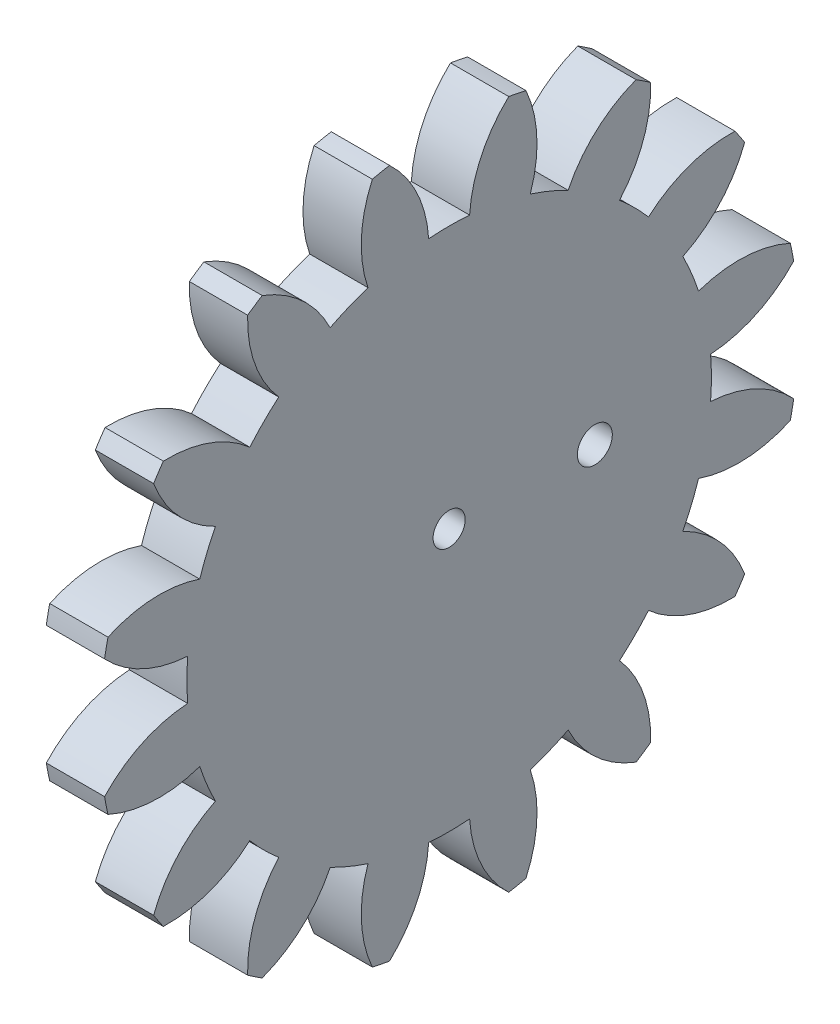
from build123d import *

# Parameters (mm, degrees)
BASPROSKE_W         = 6.35
BASPROSKE_H         = 38.1
TOOTHCUT_DEPTH      = 55.254423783
TEETHCUTS_COUNT     = 16
TEETHCUTS_ANGLE     = 337.5
BORSKE_R            = 3.175
BORE_DEPTH          = 50.8000508
SKETCH1_R           = 3.175
SKETCH1_R_2         = 1.75
BOSS_EXTRUDE1_DEPTH = 6.35
CUT_EXTRUDE1_REACH  = 55.471
SKETCH2_R           = 1.905


with BuildPart() as part:
    # BasProSke → Base-Revolve (revolve)
    with BuildSketch(Plane(origin=(0, 0, 0), x_dir=(1, 0, 0), z_dir=(0, 1, 0)), mode=Mode.PRIVATE) as base_revolve_sk:
        with Locations((3.175, 19.05)):
            Rectangle(BASPROSKE_W, BASPROSKE_H)
    revolve(base_revolve_sk.sketch.rotate(Axis((-10, 0, 0), (1, 0, 0)), 180), axis=Axis((-10, 0, 0), (1, 0, 0)))

    # TooCutSke → ToothCut (cut, through all)
    with BuildSketch(Plane(origin=(0, 0, 0), x_dir=(0, 0, -1), z_dir=(1, 0, 0))):
        with BuildLine():
            ThreePointArc((2.231335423, 28.486473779), (0, 28.57373), (-2.231335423, 28.486473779))
            ThreePointArc((-2.231335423, 28.486473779), (-3.502850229, 33.437029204), (-6.518192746, 37.564069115))
            ThreePointArc((-6.518192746, 37.564069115), (0, 38.1254), (6.518192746, 37.564069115))
            ThreePointArc((6.518192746, 37.564069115), (3.502850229, 33.437029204), (2.231335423, 28.486473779))
        make_face()
    toothcut = extrude(amount=TOOTHCUT_DEPTH, mode=Mode.SUBTRACT)

    # TeethCuts: ToothCut ×16 about axis
    teethcuts_axis = Axis((-10, 0, 0), (1, 0, 0))
    for i in range(1, TEETHCUTS_COUNT):
        add(toothcut.rotate(teethcuts_axis, i * TEETHCUTS_ANGLE / (TEETHCUTS_COUNT - 1)), mode=Mode.SUBTRACT)

    # BorSke → Bore (cut, symmetric)
    with BuildSketch(Plane(origin=(0, 0, 0), x_dir=(0, 0, -1), z_dir=(1, 0, 0))):
        with Locations(Location((0, 0, 0), (0, 0, 180))):
            Circle(BORSKE_R)
    extrude(amount=BORE_DEPTH, both=True, mode=Mode.SUBTRACT)

    # Sketch1 → Boss-Extrude1 (add)
    with BuildSketch(Plane(origin=(6.35, 0, 0), x_dir=(0, 0, -1), z_dir=(1, 0, 0))):
        Circle(SKETCH1_R)
        Circle(SKETCH1_R_2, mode=Mode.SUBTRACT)
    extrude(amount=-BOSS_EXTRUDE1_DEPTH)

    # Sketch2 → Cut-Extrude1 (cut, up to next)
    with BuildSketch(Plane(origin=(6.35, 0, 0), x_dir=(0, 0, -1), z_dir=(1, 0, 0)), mode=Mode.PRIVATE) as cut_extrude1_sk1:
        with Locations((15.875, 0)):
            Circle(SKETCH2_R)
    cut_extrude1_tool1 = extrude(cut_extrude1_sk1.sketch, amount=-CUT_EXTRUDE1_REACH, mode=Mode.PRIVATE) & part.part
    add(cut_extrude1_tool1.solids().sort_by_distance((6.35, 0, -15.875))[0], mode=Mode.SUBTRACT)


solid = part.part
